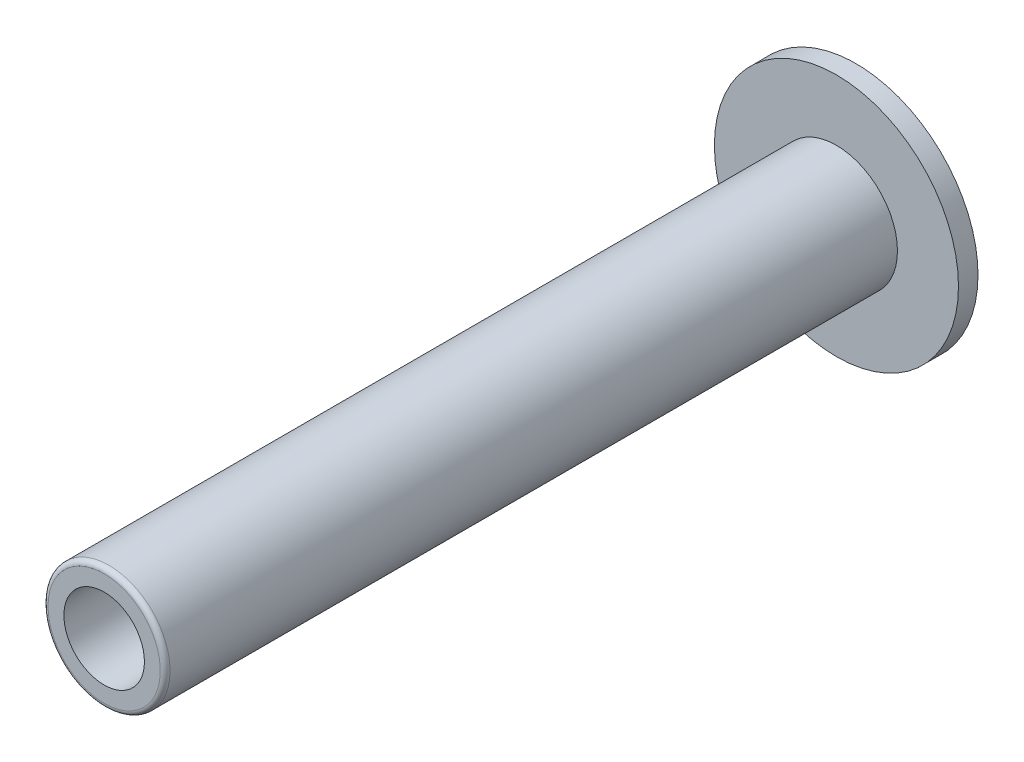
ISO-10303-21;
HEADER;
FILE_DESCRIPTION(('STEP AP214'),'2;1');
FILE_NAME('part.step','',(''),(''),'','','');
FILE_SCHEMA(('AUTOMOTIVE_DESIGN { 1 0 10303 214 1 1 1 1 }'));
ENDSEC;
DATA;
#1=APPLICATION_CONTEXT('core data for automotive mechanical design processes');
#2=APPLICATION_PROTOCOL_DEFINITION('international standard','automotive_design',2000,#1);
#3=PRODUCT_CONTEXT('',#1,'mechanical');
#4=PRODUCT('Part','Part','',(#3));
#5=PRODUCT_RELATED_PRODUCT_CATEGORY('part','',(#4));
#6=PRODUCT_DEFINITION_FORMATION('','',#4);
#7=PRODUCT_DEFINITION_CONTEXT('part definition',#1,'design');
#8=PRODUCT_DEFINITION('design','',#6,#7);
#9=PRODUCT_DEFINITION_SHAPE('','',#8);
#10=(LENGTH_UNIT() NAMED_UNIT(*) SI_UNIT(.MILLI.,.METRE.));
#11=(NAMED_UNIT(*) PLANE_ANGLE_UNIT() SI_UNIT($,.RADIAN.));
#12=(NAMED_UNIT(*) SI_UNIT($,.STERADIAN.) SOLID_ANGLE_UNIT());
#13=UNCERTAINTY_MEASURE_WITH_UNIT(LENGTH_MEASURE(1.E-05),#10,'distance_accuracy_value','');
#14=(GEOMETRIC_REPRESENTATION_CONTEXT(3) GLOBAL_UNCERTAINTY_ASSIGNED_CONTEXT((#13)) GLOBAL_UNIT_ASSIGNED_CONTEXT((#10,
#11,#12)) REPRESENTATION_CONTEXT('',''));
#15=CARTESIAN_POINT('',(0.,0.,0.));
#16=DIRECTION('',(0.,0.,1.));
#17=DIRECTION('',(1.,0.,0.));
#18=AXIS2_PLACEMENT_3D('',#15,#16,#17);
#19=CARTESIAN_POINT('',(0.,2.5,30.));
#20=DIRECTION('',(0.,0.,-1.));
#21=DIRECTION('',(-1.,0.,0.));
#22=AXIS2_PLACEMENT_3D('',#19,#20,#21);
#23=PLANE('',#22);
#24=CARTESIAN_POINT('',(0.,0.,30.));
#25=DIRECTION('',(0.,0.,1.));
#26=DIRECTION('',(1.,0.,0.));
#27=AXIS2_PLACEMENT_3D('',#24,#25,#26);
#28=CIRCLE('',#27,1.64999999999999);
#29=CARTESIAN_POINT('',(1.64999999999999,0.,30.));
#30=VERTEX_POINT('',#29);
#31=EDGE_CURVE('E128',#30,#30,#28,.T.);
#32=ORIENTED_EDGE('',*,*,#31,.F.);
#33=EDGE_LOOP('',(#32));
#34=FACE_BOUND('',#33,.T.);
#35=CARTESIAN_POINT('',(0.,0.,30.));
#36=DIRECTION('',(0.,0.,-1.));
#37=DIRECTION('',(-1.,0.,0.));
#38=AXIS2_PLACEMENT_3D('',#35,#36,#37);
#39=CIRCLE('',#38,2.3);
#40=CARTESIAN_POINT('',(-2.3,0.,30.));
#41=VERTEX_POINT('',#40);
#42=EDGE_CURVE('E188',#41,#41,#39,.F.);
#43=ORIENTED_EDGE('',*,*,#42,.T.);
#44=EDGE_LOOP('',(#43));
#45=FACE_BOUND('',#44,.T.);
#46=ADVANCED_FACE('F37',(#34,#45),#23,.F.);
#47=CARTESIAN_POINT('',(0.,0.,35.4075143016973));
#48=DIRECTION('',(0.,0.,1.));
#49=DIRECTION('',(1.,0.,0.));
#50=AXIS2_PLACEMENT_3D('',#47,#48,#49);
#51=CYLINDRICAL_SURFACE('',#50,2.5);
#52=CARTESIAN_POINT('',(0.,0.,29.8));
#53=DIRECTION('',(0.,0.,-1.));
#54=DIRECTION('',(-1.,0.,0.));
#55=AXIS2_PLACEMENT_3D('',#52,#53,#54);
#56=CIRCLE('',#55,2.5);
#57=CARTESIAN_POINT('',(-2.5,0.,29.8));
#58=VERTEX_POINT('',#57);
#59=EDGE_CURVE('E191',#58,#58,#56,.T.);
#60=ORIENTED_EDGE('',*,*,#59,.T.);
#61=EDGE_LOOP('',(#60));
#62=FACE_BOUND('',#61,.T.);
#63=CARTESIAN_POINT('',(0.,0.,0.));
#64=DIRECTION('',(0.,0.,1.));
#65=DIRECTION('',(1.,0.,0.));
#66=AXIS2_PLACEMENT_3D('',#63,#64,#65);
#67=CIRCLE('',#66,2.5);
#68=CARTESIAN_POINT('',(2.5,0.,0.));
#69=VERTEX_POINT('',#68);
#70=EDGE_CURVE('E185',#69,#69,#67,.T.);
#71=ORIENTED_EDGE('',*,*,#70,.T.);
#72=EDGE_LOOP('',(#71));
#73=FACE_BOUND('',#72,.T.);
#74=ADVANCED_FACE('F263',(#62,#73),#51,.T.);
#75=CARTESIAN_POINT('',(0.,2.5,0.));
#76=DIRECTION('',(0.,0.,-1.));
#77=DIRECTION('',(-1.,0.,0.));
#78=AXIS2_PLACEMENT_3D('',#75,#76,#77);
#79=PLANE('',#78);
#80=ORIENTED_EDGE('',*,*,#70,.F.);
#81=EDGE_LOOP('',(#80));
#82=FACE_BOUND('',#81,.T.);
#83=CARTESIAN_POINT('',(0.,0.,0.));
#84=DIRECTION('',(0.,0.,1.));
#85=DIRECTION('',(1.,0.,0.));
#86=AXIS2_PLACEMENT_3D('',#83,#84,#85);
#87=CIRCLE('',#86,5.);
#88=CARTESIAN_POINT('',(5.,0.,0.));
#89=VERTEX_POINT('',#88);
#90=EDGE_CURVE('E182',#89,#89,#87,.T.);
#91=ORIENTED_EDGE('',*,*,#90,.T.);
#92=EDGE_LOOP('',(#91));
#93=FACE_BOUND('',#92,.T.);
#94=ADVANCED_FACE('F270',(#82,#93),#79,.F.);
#95=CARTESIAN_POINT('',(0.,0.,35.4075143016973));
#96=DIRECTION('',(0.,0.,1.));
#97=DIRECTION('',(1.,0.,0.));
#98=AXIS2_PLACEMENT_3D('',#95,#96,#97);
#99=CYLINDRICAL_SURFACE('',#98,5.);
#100=ORIENTED_EDGE('',*,*,#90,.F.);
#101=EDGE_LOOP('',(#100));
#102=FACE_BOUND('',#101,.T.);
#103=CARTESIAN_POINT('',(0.,0.,-0.800000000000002));
#104=DIRECTION('',(0.,0.,1.));
#105=DIRECTION('',(1.,0.,0.));
#106=AXIS2_PLACEMENT_3D('',#103,#104,#105);
#107=CIRCLE('',#106,5.);
#108=CARTESIAN_POINT('',(5.,0.,-0.800000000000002));
#109=VERTEX_POINT('',#108);
#110=EDGE_CURVE('E160',#109,#109,#107,.T.);
#111=ORIENTED_EDGE('',*,*,#110,.T.);
#112=EDGE_LOOP('',(#111));
#113=FACE_BOUND('',#112,.T.);
#114=ADVANCED_FACE('F278',(#102,#113),#99,.T.);
#115=CARTESIAN_POINT('',(0.,0.,7.42857142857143));
#116=DIRECTION('',(0.,0.,1.));
#117=DIRECTION('',(0.,1.,0.));
#118=AXIS2_PLACEMENT_3D('',#115,#116,#117);
#119=SPHERICAL_SURFACE('',#118,9.62857142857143);
#120=CARTESIAN_POINT('',(0.,0.5,7.42857142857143));
#121=DIRECTION('',(0.,1.,0.));
#122=DIRECTION('',(0.,0.,1.));
#123=AXIS2_PLACEMENT_3D('',#120,#121,#122);
#124=CIRCLE('',#123,9.61558046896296);
#125=CARTESIAN_POINT('',(4.24348239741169,0.5,-1.2));
#126=VERTEX_POINT('',#125);
#127=CARTESIAN_POINT('',(0.5,0.5,-2.17400050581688));
#128=VERTEX_POINT('',#127);
#129=EDGE_CURVE('E197',#126,#128,#124,.T.);
#130=ORIENTED_EDGE('',*,*,#129,.T.);
#131=CARTESIAN_POINT('',(0.5,0.,7.42857142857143));
#132=DIRECTION('',(1.,0.,0.));
#133=DIRECTION('',(0.,1.,0.));
#134=AXIS2_PLACEMENT_3D('',#131,#132,#133);
#135=CIRCLE('',#134,9.61558046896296);
#136=CARTESIAN_POINT('',(0.5,2.,-1.97671366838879));
#137=VERTEX_POINT('',#136);
#138=EDGE_CURVE('E11',#128,#137,#135,.T.);
#139=ORIENTED_EDGE('',*,*,#138,.T.);
#140=CARTESIAN_POINT('',(0.,2.,7.42857142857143));
#141=DIRECTION('',(0.,1.,0.));
#142=DIRECTION('',(-1.,0.,0.));
#143=AXIS2_PLACEMENT_3D('',#140,#141,#142);
#144=CIRCLE('',#143,9.41856611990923);
#145=CARTESIAN_POINT('',(-0.5,2.,-1.97671366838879));
#146=VERTEX_POINT('',#145);
#147=EDGE_CURVE('E45',#137,#146,#144,.T.);
#148=ORIENTED_EDGE('',*,*,#147,.T.);
#149=CARTESIAN_POINT('',(-0.5,0.,7.42857142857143));
#150=DIRECTION('',(-1.,0.,0.));
#151=DIRECTION('',(0.,-1.,0.));
#152=AXIS2_PLACEMENT_3D('',#149,#150,#151);
#153=CIRCLE('',#152,9.61558046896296);
#154=CARTESIAN_POINT('',(-0.5,0.5,-2.17400050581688));
#155=VERTEX_POINT('',#154);
#156=EDGE_CURVE('E217',#146,#155,#153,.T.);
#157=ORIENTED_EDGE('',*,*,#156,.T.);
#158=CARTESIAN_POINT('',(0.,0.5,7.42857142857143));
#159=DIRECTION('',(0.,1.,0.));
#160=DIRECTION('',(0.,0.,1.));
#161=AXIS2_PLACEMENT_3D('',#158,#159,#160);
#162=CIRCLE('',#161,9.61558046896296);
#163=CARTESIAN_POINT('',(-4.24348239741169,0.5,-1.2));
#164=VERTEX_POINT('',#163);
#165=EDGE_CURVE('E214',#155,#164,#162,.T.);
#166=ORIENTED_EDGE('',*,*,#165,.T.);
#167=CARTESIAN_POINT('',(0.,0.,-1.2));
#168=DIRECTION('',(0.,0.,1.));
#169=DIRECTION('',(1.,0.,0.));
#170=AXIS2_PLACEMENT_3D('',#167,#168,#169);
#171=CIRCLE('',#170,4.27283779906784);
#172=CARTESIAN_POINT('',(-4.24348239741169,-0.5,-1.2));
#173=VERTEX_POINT('',#172);
#174=EDGE_CURVE('E198',#164,#173,#171,.T.);
#175=ORIENTED_EDGE('',*,*,#174,.T.);
#176=CARTESIAN_POINT('',(0.,-0.5,7.42857142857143));
#177=DIRECTION('',(0.,-1.,0.));
#178=DIRECTION('',(1.,0.,0.));
#179=AXIS2_PLACEMENT_3D('',#176,#177,#178);
#180=CIRCLE('',#179,9.61558046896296);
#181=CARTESIAN_POINT('',(-0.5,-0.5,-2.17400050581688));
#182=VERTEX_POINT('',#181);
#183=EDGE_CURVE('E211',#173,#182,#180,.T.);
#184=ORIENTED_EDGE('',*,*,#183,.T.);
#185=CARTESIAN_POINT('',(-0.5,0.,7.42857142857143));
#186=DIRECTION('',(-1.,0.,0.));
#187=DIRECTION('',(0.,0.,1.));
#188=AXIS2_PLACEMENT_3D('',#185,#186,#187);
#189=CIRCLE('',#188,9.61558046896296);
#190=CARTESIAN_POINT('',(-0.5,-2.,-1.97671366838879));
#191=VERTEX_POINT('',#190);
#192=EDGE_CURVE('E60',#182,#191,#189,.T.);
#193=ORIENTED_EDGE('',*,*,#192,.T.);
#194=CARTESIAN_POINT('',(0.,-2.,7.42857142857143));
#195=DIRECTION('',(0.,-1.,0.));
#196=DIRECTION('',(0.,0.,-1.));
#197=AXIS2_PLACEMENT_3D('',#194,#195,#196);
#198=CIRCLE('',#197,9.41856611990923);
#199=CARTESIAN_POINT('',(0.5,-2.,-1.97671366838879));
#200=VERTEX_POINT('',#199);
#201=EDGE_CURVE('E207',#191,#200,#198,.T.);
#202=ORIENTED_EDGE('',*,*,#201,.T.);
#203=CARTESIAN_POINT('',(0.5,0.,7.42857142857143));
#204=DIRECTION('',(1.,0.,0.));
#205=DIRECTION('',(0.,1.,0.));
#206=AXIS2_PLACEMENT_3D('',#203,#204,#205);
#207=CIRCLE('',#206,9.61558046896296);
#208=CARTESIAN_POINT('',(0.5,-0.5,-2.17400050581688));
#209=VERTEX_POINT('',#208);
#210=EDGE_CURVE('E204',#200,#209,#207,.T.);
#211=ORIENTED_EDGE('',*,*,#210,.T.);
#212=CARTESIAN_POINT('',(0.,-0.5,7.42857142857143));
#213=DIRECTION('',(0.,-1.,0.));
#214=DIRECTION('',(1.,0.,0.));
#215=AXIS2_PLACEMENT_3D('',#212,#213,#214);
#216=CIRCLE('',#215,9.61558046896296);
#217=CARTESIAN_POINT('',(4.24348239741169,-0.5,-1.2));
#218=VERTEX_POINT('',#217);
#219=EDGE_CURVE('E201',#209,#218,#216,.T.);
#220=ORIENTED_EDGE('',*,*,#219,.T.);
#221=EDGE_CURVE('E194',#218,#126,#171,.T.);
#222=ORIENTED_EDGE('',*,*,#221,.T.);
#223=EDGE_LOOP('',(#130,#139,#148,#157,#166,#175,#184,#193,#202,#211,#220,#222));
#224=FACE_BOUND('',#223,.T.);
#225=ORIENTED_EDGE('',*,*,#110,.F.);
#226=EDGE_LOOP('',(#225));
#227=FACE_BOUND('',#226,.T.);
#228=ADVANCED_FACE('F221',(#224,#227),#119,.T.);
#229=CARTESIAN_POINT('',(0.,0.,29.8));
#230=DIRECTION('',(0.,0.,-1.));
#231=DIRECTION('',(-1.,0.,0.));
#232=AXIS2_PLACEMENT_3D('',#229,#230,#231);
#233=TOROIDAL_SURFACE('',#232,2.3,0.2);
#234=ORIENTED_EDGE('',*,*,#59,.F.);
#235=EDGE_LOOP('',(#234));
#236=FACE_BOUND('',#235,.T.);
#237=ORIENTED_EDGE('',*,*,#42,.F.);
#238=EDGE_LOOP('',(#237));
#239=FACE_BOUND('',#238,.T.);
#240=ADVANCED_FACE('F39',(#236,#239),#233,.T.);
#241=CARTESIAN_POINT('',(-0.5,-0.5,-1.2));
#242=DIRECTION('',(0.,-1.,0.));
#243=DIRECTION('',(1.,0.,0.));
#244=AXIS2_PLACEMENT_3D('',#241,#242,#243);
#245=PLANE('',#244);
#246=DIRECTION('',(-1.,0.,0.));
#247=VECTOR('',#246,1.);
#248=CARTESIAN_POINT('',(-0.5,-0.5,-1.2));
#249=LINE('',#248,#247);
#250=CARTESIAN_POINT('',(-0.5,-0.5,-1.2));
#251=VERTEX_POINT('',#250);
#252=EDGE_CURVE('E154',#251,#173,#249,.T.);
#253=ORIENTED_EDGE('',*,*,#252,.F.);
#254=DIRECTION('',(0.,0.,-1.));
#255=VECTOR('',#254,1.);
#256=CARTESIAN_POINT('',(-0.5,-0.5,-1.2));
#257=LINE('',#256,#255);
#258=EDGE_CURVE('E158',#251,#182,#257,.T.);
#259=ORIENTED_EDGE('',*,*,#258,.T.);
#260=ORIENTED_EDGE('',*,*,#183,.F.);
#261=EDGE_LOOP('',(#253,#259,#260));
#262=FACE_BOUND('',#261,.T.);
#263=ADVANCED_FACE('F240',(#262),#245,.F.);
#264=CARTESIAN_POINT('',(-0.5,-0.5,-1.2));
#265=DIRECTION('',(-1.,0.,0.));
#266=DIRECTION('',(0.,0.,1.));
#267=AXIS2_PLACEMENT_3D('',#264,#265,#266);
#268=PLANE('',#267);
#269=ORIENTED_EDGE('',*,*,#258,.F.);
#270=DIRECTION('',(0.,1.,0.));
#271=VECTOR('',#270,1.);
#272=CARTESIAN_POINT('',(-0.5,-0.5,-1.2));
#273=LINE('',#272,#271);
#274=CARTESIAN_POINT('',(-0.5,-2.,-1.2));
#275=VERTEX_POINT('',#274);
#276=EDGE_CURVE('E151',#275,#251,#273,.T.);
#277=ORIENTED_EDGE('',*,*,#276,.F.);
#278=DIRECTION('',(0.,0.,-1.));
#279=VECTOR('',#278,1.);
#280=CARTESIAN_POINT('',(-0.5,-2.,-1.2));
#281=LINE('',#280,#279);
#282=EDGE_CURVE('E161',#275,#191,#281,.T.);
#283=ORIENTED_EDGE('',*,*,#282,.T.);
#284=ORIENTED_EDGE('',*,*,#192,.F.);
#285=EDGE_LOOP('',(#269,#277,#283,#284));
#286=FACE_BOUND('',#285,.T.);
#287=ADVANCED_FACE('F241',(#286),#268,.F.);
#288=CARTESIAN_POINT('',(0.5,-2.,-1.2));
#289=DIRECTION('',(0.,-1.,0.));
#290=DIRECTION('',(0.,0.,-1.));
#291=AXIS2_PLACEMENT_3D('',#288,#289,#290);
#292=PLANE('',#291);
#293=ORIENTED_EDGE('',*,*,#282,.F.);
#294=DIRECTION('',(-1.,0.,0.));
#295=VECTOR('',#294,1.);
#296=CARTESIAN_POINT('',(0.5,-2.,-1.2));
#297=LINE('',#296,#295);
#298=CARTESIAN_POINT('',(0.5,-2.,-1.2));
#299=VERTEX_POINT('',#298);
#300=EDGE_CURVE('E148',#299,#275,#297,.T.);
#301=ORIENTED_EDGE('',*,*,#300,.F.);
#302=DIRECTION('',(0.,0.,-1.));
#303=VECTOR('',#302,1.);
#304=CARTESIAN_POINT('',(0.5,-2.,-1.2));
#305=LINE('',#304,#303);
#306=EDGE_CURVE('E163',#299,#200,#305,.T.);
#307=ORIENTED_EDGE('',*,*,#306,.T.);
#308=ORIENTED_EDGE('',*,*,#201,.F.);
#309=EDGE_LOOP('',(#293,#301,#307,#308));
#310=FACE_BOUND('',#309,.T.);
#311=ADVANCED_FACE('F245',(#310),#292,.F.);
#312=CARTESIAN_POINT('',(0.5,-0.5,-1.2));
#313=DIRECTION('',(1.,0.,0.));
#314=DIRECTION('',(0.,1.,0.));
#315=AXIS2_PLACEMENT_3D('',#312,#313,#314);
#316=PLANE('',#315);
#317=ORIENTED_EDGE('',*,*,#306,.F.);
#318=DIRECTION('',(0.,-1.,0.));
#319=VECTOR('',#318,1.);
#320=CARTESIAN_POINT('',(0.5,-0.5,-1.2));
#321=LINE('',#320,#319);
#322=CARTESIAN_POINT('',(0.5,-0.5,-1.2));
#323=VERTEX_POINT('',#322);
#324=EDGE_CURVE('E145',#323,#299,#321,.T.);
#325=ORIENTED_EDGE('',*,*,#324,.F.);
#326=DIRECTION('',(0.,0.,-1.));
#327=VECTOR('',#326,1.);
#328=CARTESIAN_POINT('',(0.5,-0.5,-1.2));
#329=LINE('',#328,#327);
#330=EDGE_CURVE('E166',#323,#209,#329,.T.);
#331=ORIENTED_EDGE('',*,*,#330,.T.);
#332=ORIENTED_EDGE('',*,*,#210,.F.);
#333=EDGE_LOOP('',(#317,#325,#331,#332));
#334=FACE_BOUND('',#333,.T.);
#335=ADVANCED_FACE('F247',(#334),#316,.F.);
#336=CARTESIAN_POINT('',(6.,-0.5,-1.2));
#337=DIRECTION('',(0.,-1.,0.));
#338=DIRECTION('',(1.,0.,0.));
#339=AXIS2_PLACEMENT_3D('',#336,#337,#338);
#340=PLANE('',#339);
#341=ORIENTED_EDGE('',*,*,#330,.F.);
#342=DIRECTION('',(-1.,0.,0.));
#343=VECTOR('',#342,1.);
#344=CARTESIAN_POINT('',(6.,-0.5,-1.2));
#345=LINE('',#344,#343);
#346=EDGE_CURVE('E143',#218,#323,#345,.T.);
#347=ORIENTED_EDGE('',*,*,#346,.F.);
#348=ORIENTED_EDGE('',*,*,#219,.F.);
#349=EDGE_LOOP('',(#341,#347,#348));
#350=FACE_BOUND('',#349,.T.);
#351=ADVANCED_FACE('F251',(#350),#340,.F.);
#352=CARTESIAN_POINT('',(6.,0.5,-1.2));
#353=DIRECTION('',(0.,1.,0.));
#354=DIRECTION('',(0.,0.,1.));
#355=AXIS2_PLACEMENT_3D('',#352,#353,#354);
#356=PLANE('',#355);
#357=DIRECTION('',(1.,0.,0.));
#358=VECTOR('',#357,1.);
#359=CARTESIAN_POINT('',(6.,0.5,-1.2));
#360=LINE('',#359,#358);
#361=CARTESIAN_POINT('',(0.5,0.5,-1.2));
#362=VERTEX_POINT('',#361);
#363=EDGE_CURVE('E52',#362,#126,#360,.T.);
#364=ORIENTED_EDGE('',*,*,#363,.F.);
#365=DIRECTION('',(0.,0.,-1.));
#366=VECTOR('',#365,1.);
#367=CARTESIAN_POINT('',(0.5,0.5,-1.2));
#368=LINE('',#367,#366);
#369=EDGE_CURVE('E169',#362,#128,#368,.T.);
#370=ORIENTED_EDGE('',*,*,#369,.T.);
#371=ORIENTED_EDGE('',*,*,#129,.F.);
#372=EDGE_LOOP('',(#364,#370,#371));
#373=FACE_BOUND('',#372,.T.);
#374=ADVANCED_FACE('F253',(#373),#356,.F.);
#375=CARTESIAN_POINT('',(0.5,2.,-1.2));
#376=DIRECTION('',(1.,0.,0.));
#377=DIRECTION('',(0.,1.,0.));
#378=AXIS2_PLACEMENT_3D('',#375,#376,#377);
#379=PLANE('',#378);
#380=ORIENTED_EDGE('',*,*,#369,.F.);
#381=DIRECTION('',(0.,-1.,0.));
#382=VECTOR('',#381,1.);
#383=CARTESIAN_POINT('',(0.5,2.,-1.2));
#384=LINE('',#383,#382);
#385=CARTESIAN_POINT('',(0.5,2.,-1.2));
#386=VERTEX_POINT('',#385);
#387=EDGE_CURVE('E140',#386,#362,#384,.T.);
#388=ORIENTED_EDGE('',*,*,#387,.F.);
#389=DIRECTION('',(0.,0.,-1.));
#390=VECTOR('',#389,1.);
#391=CARTESIAN_POINT('',(0.5,2.,-1.2));
#392=LINE('',#391,#390);
#393=EDGE_CURVE('E172',#386,#137,#392,.T.);
#394=ORIENTED_EDGE('',*,*,#393,.T.);
#395=ORIENTED_EDGE('',*,*,#138,.F.);
#396=EDGE_LOOP('',(#380,#388,#394,#395));
#397=FACE_BOUND('',#396,.T.);
#398=ADVANCED_FACE('F228',(#397),#379,.F.);
#399=CARTESIAN_POINT('',(0.5,2.,-1.2));
#400=DIRECTION('',(0.,1.,0.));
#401=DIRECTION('',(-1.,0.,0.));
#402=AXIS2_PLACEMENT_3D('',#399,#400,#401);
#403=PLANE('',#402);
#404=ORIENTED_EDGE('',*,*,#393,.F.);
#405=DIRECTION('',(1.,0.,0.));
#406=VECTOR('',#405,1.);
#407=CARTESIAN_POINT('',(0.5,2.,-1.2));
#408=LINE('',#407,#406);
#409=CARTESIAN_POINT('',(-0.5,2.,-1.2));
#410=VERTEX_POINT('',#409);
#411=EDGE_CURVE('E137',#410,#386,#408,.T.);
#412=ORIENTED_EDGE('',*,*,#411,.F.);
#413=DIRECTION('',(0.,0.,-1.));
#414=VECTOR('',#413,1.);
#415=CARTESIAN_POINT('',(-0.5,2.,-1.2));
#416=LINE('',#415,#414);
#417=EDGE_CURVE('E175',#410,#146,#416,.T.);
#418=ORIENTED_EDGE('',*,*,#417,.T.);
#419=ORIENTED_EDGE('',*,*,#147,.F.);
#420=EDGE_LOOP('',(#404,#412,#418,#419));
#421=FACE_BOUND('',#420,.T.);
#422=ADVANCED_FACE('F224',(#421),#403,.F.);
#423=CARTESIAN_POINT('',(-0.5,2.,-1.2));
#424=DIRECTION('',(-1.,0.,0.));
#425=DIRECTION('',(0.,-1.,0.));
#426=AXIS2_PLACEMENT_3D('',#423,#424,#425);
#427=PLANE('',#426);
#428=ORIENTED_EDGE('',*,*,#417,.F.);
#429=DIRECTION('',(0.,1.,0.));
#430=VECTOR('',#429,1.);
#431=CARTESIAN_POINT('',(-0.5,2.,-1.2));
#432=LINE('',#431,#430);
#433=CARTESIAN_POINT('',(-0.5,0.5,-1.2));
#434=VERTEX_POINT('',#433);
#435=EDGE_CURVE('E130',#434,#410,#432,.T.);
#436=ORIENTED_EDGE('',*,*,#435,.F.);
#437=DIRECTION('',(0.,0.,-1.));
#438=VECTOR('',#437,1.);
#439=CARTESIAN_POINT('',(-0.5,0.5,-1.2));
#440=LINE('',#439,#438);
#441=EDGE_CURVE('E157',#434,#155,#440,.T.);
#442=ORIENTED_EDGE('',*,*,#441,.T.);
#443=ORIENTED_EDGE('',*,*,#156,.F.);
#444=EDGE_LOOP('',(#428,#436,#442,#443));
#445=FACE_BOUND('',#444,.T.);
#446=ADVANCED_FACE('F233',(#445),#427,.F.);
#447=CARTESIAN_POINT('',(-0.5,0.5,-1.2));
#448=DIRECTION('',(0.,1.,0.));
#449=DIRECTION('',(0.,0.,1.));
#450=AXIS2_PLACEMENT_3D('',#447,#448,#449);
#451=PLANE('',#450);
#452=ORIENTED_EDGE('',*,*,#441,.F.);
#453=DIRECTION('',(1.,0.,0.));
#454=VECTOR('',#453,1.);
#455=CARTESIAN_POINT('',(-0.5,0.5,-1.2));
#456=LINE('',#455,#454);
#457=EDGE_CURVE('E127',#164,#434,#456,.T.);
#458=ORIENTED_EDGE('',*,*,#457,.F.);
#459=ORIENTED_EDGE('',*,*,#165,.F.);
#460=EDGE_LOOP('',(#452,#458,#459));
#461=FACE_BOUND('',#460,.T.);
#462=ADVANCED_FACE('F235',(#461),#451,.F.);
#463=CARTESIAN_POINT('',(0.,0.,-1.2));
#464=DIRECTION('',(0.,0.,1.));
#465=DIRECTION('',(1.,0.,0.));
#466=AXIS2_PLACEMENT_3D('',#463,#464,#465);
#467=PLANE('',#466);
#468=ORIENTED_EDGE('',*,*,#457,.T.);
#469=ORIENTED_EDGE('',*,*,#435,.T.);
#470=ORIENTED_EDGE('',*,*,#411,.T.);
#471=ORIENTED_EDGE('',*,*,#387,.T.);
#472=ORIENTED_EDGE('',*,*,#363,.T.);
#473=ORIENTED_EDGE('',*,*,#221,.F.);
#474=ORIENTED_EDGE('',*,*,#346,.T.);
#475=ORIENTED_EDGE('',*,*,#324,.T.);
#476=ORIENTED_EDGE('',*,*,#300,.T.);
#477=ORIENTED_EDGE('',*,*,#276,.T.);
#478=ORIENTED_EDGE('',*,*,#252,.T.);
#479=ORIENTED_EDGE('',*,*,#174,.F.);
#480=EDGE_LOOP('',(#468,#469,#470,#471,#472,#473,#474,#475,#476,#477,#478,#479));
#481=FACE_BOUND('',#480,.T.);
#482=ADVANCED_FACE('F121',(#481),#467,.F.);
#483=CARTESIAN_POINT('',(0.,0.,10.));
#484=DIRECTION('',(0.,0.,1.));
#485=DIRECTION('',(1.,0.,0.));
#486=AXIS2_PLACEMENT_3D('',#483,#484,#485);
#487=CONICAL_SURFACE('',#486,1.65,1.02974425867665);
#488=CARTESIAN_POINT('',(0.,0.,9.00857997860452));
#489=VERTEX_POINT('',#488);
#490=VERTEX_LOOP('',#489);
#491=FACE_BOUND('',#490,.T.);
#492=CARTESIAN_POINT('',(0.,0.,10.));
#493=DIRECTION('',(0.,0.,1.));
#494=DIRECTION('',(1.,0.,0.));
#495=AXIS2_PLACEMENT_3D('',#492,#493,#494);
#496=CIRCLE('',#495,1.65);
#497=CARTESIAN_POINT('',(1.65,0.,10.));
#498=VERTEX_POINT('',#497);
#499=EDGE_CURVE('E125',#498,#498,#496,.T.);
#500=ORIENTED_EDGE('',*,*,#499,.T.);
#501=EDGE_LOOP('',(#500));
#502=FACE_BOUND('',#501,.T.);
#503=ADVANCED_FACE('F117',(#491,#502),#487,.F.);
#504=CARTESIAN_POINT('',(0.,0.,30.));
#505=DIRECTION('',(0.,0.,1.));
#506=DIRECTION('',(1.,0.,0.));
#507=AXIS2_PLACEMENT_3D('',#504,#505,#506);
#508=CYLINDRICAL_SURFACE('',#507,1.64999999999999);
#509=ORIENTED_EDGE('',*,*,#499,.F.);
#510=EDGE_LOOP('',(#509));
#511=FACE_BOUND('',#510,.T.);
#512=ORIENTED_EDGE('',*,*,#31,.T.);
#513=EDGE_LOOP('',(#512));
#514=FACE_BOUND('',#513,.T.);
#515=ADVANCED_FACE('F120',(#511,#514),#508,.F.);
#516=CLOSED_SHELL('',(#46,#74,#94,#114,#228,#240,#263,#287,#311,#335,#351,#374,#398,#422,#446,
#462,#482,#503,#515));
#517=MANIFOLD_SOLID_BREP('B2',#516);
#518=ADVANCED_BREP_SHAPE_REPRESENTATION('',(#18,#517),#14);
#519=SHAPE_DEFINITION_REPRESENTATION(#9,#518);
ENDSEC;
END-ISO-10303-21;
